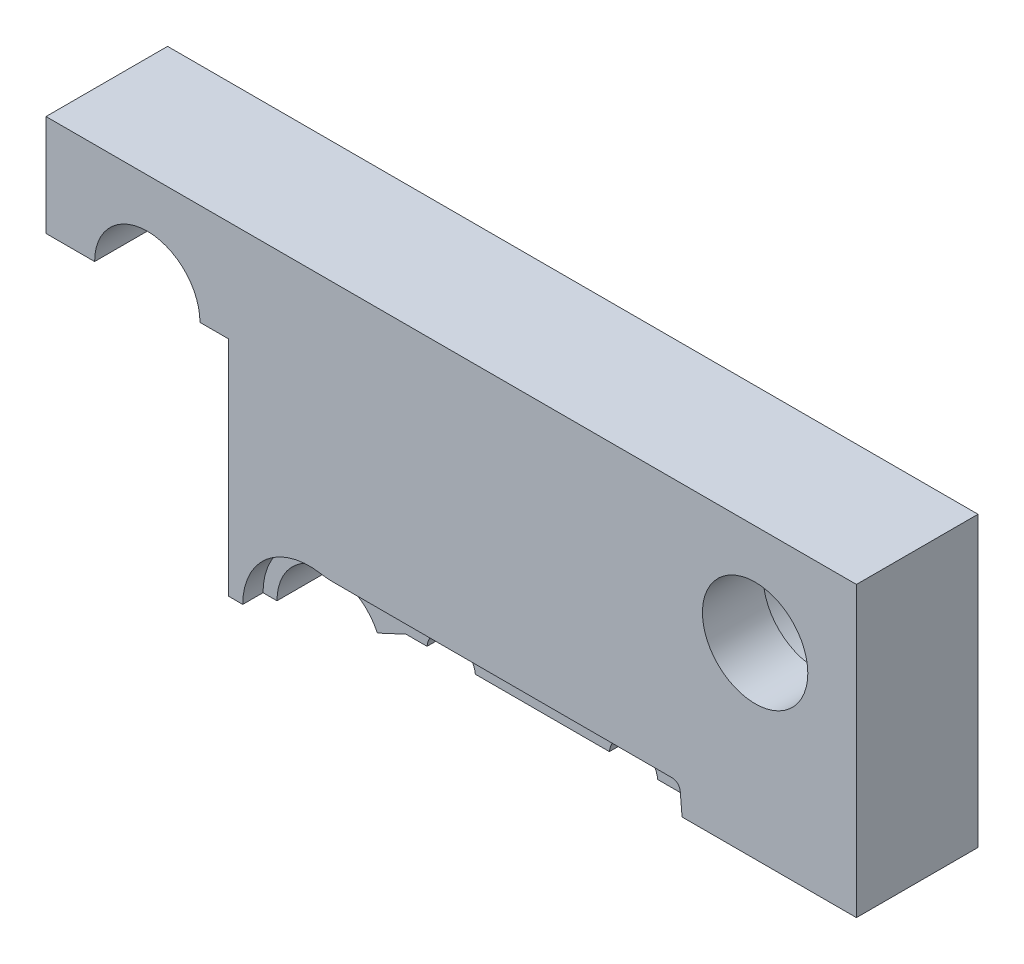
from build123d import *

# Parameters (mm, degrees)
ESQUISSE1_W                  = 200
ESQUISSE1_H                  = 150
BASE_EXTRUSION_DEPTH         = 30
ENL_V_MAT_EXTRU_1_DEPTH      = 5
ESQUISSE3_R                  = 13
ENL_V_MAT_EXTRU_2_DEPTH      = 252.246890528
ESQUISSE6_R                  = 6
ENL_V_MAT_EXTRU_5_DEPTH      = 13
ESQUISSE7_R                  = 9
ENL_V_MAT_EXTRU_6_DEPTH      = 251.647162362
ESQUISSE8_R                  = 13
ENL_V_MAT_EXTRU_7_DEPTH      = 15
ESQUISSE9_R                  = 20
ENL_V_MAT_EXTRU_8_DEPTH      = 251.449595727
ENL_V_MAT_EXTRU_9_DEPTH      = 252.79356624
ENL_V_MAT_EXTRU_9_DEPTH_BACK = 252.79356624


with BuildPart() as part:
    # Esquisse1 → Base-Extrusion (new body)
    with BuildSketch(Plane.XY):
        with Locations((100, 75)):
            Rectangle(ESQUISSE1_W, ESQUISSE1_H)
    extrude(amount=BASE_EXTRUSION_DEPTH)

    # Esquisse2 → Enl_v. mat.-Extru.1 (cut)
    with BuildSketch(Plane.XY.offset(30)):
        with BuildLine():
            Line((71.07819052, 85.935), (154.489847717, 85.935))
            ThreePointArc((154.489847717, 85.935), (155.861295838, 85.401672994), (156.512122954, 84.081926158))
            Line((156.512122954, 84.081926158), (157.033723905, 78.12))
            Line((157.033723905, 78.12), (156.512122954, 72.158073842))
            ThreePointArc((156.512122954, 72.158073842), (155.861295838, 70.838327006), (154.489847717, 70.305))
            Line((154.489847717, 70.305), (95.681427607, 70.305))
            ThreePointArc((95.681427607, 70.305), (86.083538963, 67.855711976), (78.832928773, 61.106850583))
            ThreePointArc((78.832928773, 61.106850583), (49.957582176, 63.354423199), (67.740393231, 86.215063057))
            ThreePointArc((67.740393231, 86.215063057), (69.403427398, 86.005138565), (71.07819052, 85.935))
        make_face()
    extrude(amount=-ENL_V_MAT_EXTRU_1_DEPTH, mode=Mode.SUBTRACT)

    # Esquisse3 → Enl_v. mat.-Extru.2 (cut, through all)
    with BuildSketch(Plane.XY.offset(25)):
        with Locations((65, 70)):
            Circle(ESQUISSE3_R)
    extrude(amount=-ENL_V_MAT_EXTRU_2_DEPTH, mode=Mode.SUBTRACT)

    # Esquisse6 → Enl_v. mat.-Extru.5 (cut)
    with BuildSketch(Plane.XY.offset(25)):
        with Locations((140, 78.12)):
            Circle(ESQUISSE6_R)
        with Locations((95, 78.12)):
            Circle(ESQUISSE6_R)
    extrude(amount=-ENL_V_MAT_EXTRU_5_DEPTH, mode=Mode.SUBTRACT)

    # Esquisse7 → Enl_v. mat.-Extru.6 (cut, through all)
    with BuildSketch(Plane.XY.offset(12)):
        with Locations((140, 78.12)):
            Circle(ESQUISSE7_R)
        with Locations((95, 78.12)):
            Circle(ESQUISSE7_R)
    extrude(amount=-ENL_V_MAT_EXTRU_6_DEPTH, mode=Mode.SUBTRACT)

    # Esquisse8 → Enl_v. mat.-Extru.7 (cut)
    with BuildSketch(Plane.XY.offset(30)):
        with Locations((25, 125)):
            Circle(ESQUISSE8_R)
        with Locations((25, 25)):
            Circle(ESQUISSE8_R)
        with Locations((175, 25)):
            Circle(ESQUISSE8_R)
        with Locations((175, 125)):
            Circle(ESQUISSE8_R)
    extrude(amount=-ENL_V_MAT_EXTRU_7_DEPTH, mode=Mode.SUBTRACT)

    # Esquisse9 → Enl_v. mat.-Extru.8 (cut, through all)
    with BuildSketch(Plane.XY.offset(15)):
        with Locations((25, 125)):
            Circle(ESQUISSE9_R)
        with Locations((175, 125)):
            Circle(ESQUISSE9_R)
        with Locations((175, 25)):
            Circle(ESQUISSE9_R)
        with Locations((25, 25)):
            Circle(ESQUISSE9_R)
    extrude(amount=-ENL_V_MAT_EXTRU_8_DEPTH, mode=Mode.SUBTRACT)

    # Esquisse10 → Enl_v. mat.-Extru.9 (cut, two sides: drawn at the far end of the back side and taken through both)
    with BuildSketch(Plane.XY.offset(30).offset(-ENL_V_MAT_EXTRU_9_DEPTH_BACK)):
        Polygon((-504.72289588, 125), (-8.508977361, 125), (45, 125), (45, 70), (65, 70), (83.832367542, 78.781677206), (205.091800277, 78.781677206), (701.305718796, 78.781677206), (663.301060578, -912.918205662), (-542.727554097, -866.699882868), align=None)
    extrude(amount=ENL_V_MAT_EXTRU_9_DEPTH + ENL_V_MAT_EXTRU_9_DEPTH_BACK, mode=Mode.SUBTRACT)


solid = part.part
